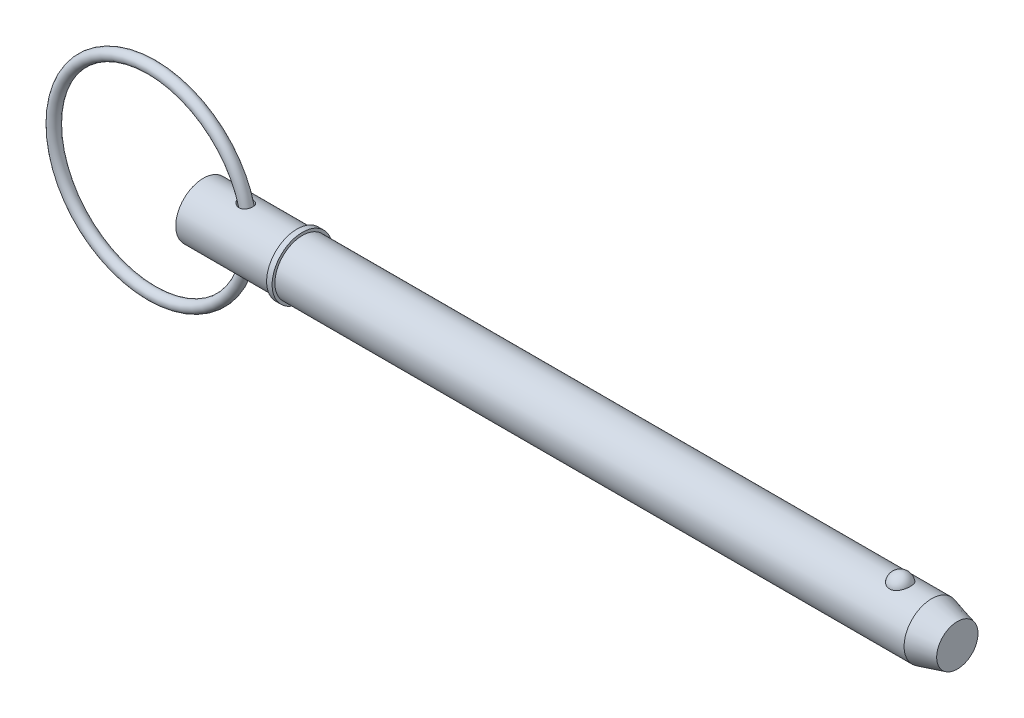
ISO-10303-21;
HEADER;
FILE_DESCRIPTION(('STEP AP214'),'2;1');
FILE_NAME('part.step','',(''),(''),'','','');
FILE_SCHEMA(('AUTOMOTIVE_DESIGN { 1 0 10303 214 1 1 1 1 }'));
ENDSEC;
DATA;
#1=APPLICATION_CONTEXT('core data for automotive mechanical design processes');
#2=APPLICATION_PROTOCOL_DEFINITION('international standard','automotive_design',2000,#1);
#3=PRODUCT_CONTEXT('',#1,'mechanical');
#4=PRODUCT('Part','Part','',(#3));
#5=PRODUCT_RELATED_PRODUCT_CATEGORY('part','',(#4));
#6=PRODUCT_DEFINITION_FORMATION('','',#4);
#7=PRODUCT_DEFINITION_CONTEXT('part definition',#1,'design');
#8=PRODUCT_DEFINITION('design','',#6,#7);
#9=PRODUCT_DEFINITION_SHAPE('','',#8);
#10=(LENGTH_UNIT() NAMED_UNIT(*) SI_UNIT(.MILLI.,.METRE.));
#11=(NAMED_UNIT(*) PLANE_ANGLE_UNIT() SI_UNIT($,.RADIAN.));
#12=(NAMED_UNIT(*) SI_UNIT($,.STERADIAN.) SOLID_ANGLE_UNIT());
#13=UNCERTAINTY_MEASURE_WITH_UNIT(LENGTH_MEASURE(1.E-05),#10,'distance_accuracy_value','');
#14=(GEOMETRIC_REPRESENTATION_CONTEXT(3) GLOBAL_UNCERTAINTY_ASSIGNED_CONTEXT((#13)) GLOBAL_UNIT_ASSIGNED_CONTEXT((#10,
#11,#12)) REPRESENTATION_CONTEXT('',''));
#15=CARTESIAN_POINT('',(0.,0.,0.));
#16=DIRECTION('',(0.,0.,1.));
#17=DIRECTION('',(1.,0.,0.));
#18=AXIS2_PLACEMENT_3D('',#15,#16,#17);
#19=CARTESIAN_POINT('',(-13.3805387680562,0.,0.));
#20=DIRECTION('',(0.,0.,1.));
#21=DIRECTION('',(1.,0.,0.));
#22=AXIS2_PLACEMENT_3D('',#19,#20,#21);
#23=TOROIDAL_SURFACE('',#22,25.4,1.429);
#24=CARTESIAN_POINT('',(13.4484612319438,0.,0.));
#25=VERTEX_POINT('',#24);
#26=VERTEX_LOOP('',#25);
#27=FACE_BOUND('',#26,.T.);
#28=ADVANCED_FACE('P0_F12',(#27),#23,.T.);
#29=CLOSED_SHELL('',(#28));
#30=MANIFOLD_SOLID_BREP('P0_B1',#29);
#31=CARTESIAN_POINT('',(0.,0.,0.));
#32=DIRECTION('',(1.,0.,0.));
#33=DIRECTION('',(0.,0.,-1.));
#34=AXIS2_PLACEMENT_3D('',#31,#32,#33);
#35=CYLINDRICAL_SURFACE('',#34,7.145);
#36=CARTESIAN_POINT('',(9.43029029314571,7.0820748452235,-0.946171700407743));
#37=CARTESIAN_POINT('',(9.49289741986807,7.07004660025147,-1.03619677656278));
#38=CARTESIAN_POINT('',(9.56370593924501,7.05703049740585,-1.12049617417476));
#39=CARTESIAN_POINT('',(9.71869321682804,7.03060933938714,-1.27585605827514));
#40=CARTESIAN_POINT('',(9.80290151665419,7.01720347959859,-1.34688652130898));
#41=CARTESIAN_POINT('',(9.98160385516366,6.99158714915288,-1.47408585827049));
#42=CARTESIAN_POINT('',(10.0760626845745,6.97937284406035,-1.53030346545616));
#43=CARTESIAN_POINT('',(10.2729508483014,6.95747410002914,-1.62697341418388));
#44=CARTESIAN_POINT('',(10.3753769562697,6.9477886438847,-1.66743209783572));
#45=CARTESIAN_POINT('',(10.5898946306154,6.93181594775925,-1.73266776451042));
#46=CARTESIAN_POINT('',(10.7022085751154,6.92567913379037,-1.75675727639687));
#47=CARTESIAN_POINT('',(10.9294935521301,6.91839634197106,-1.78523005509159));
#48=CARTESIAN_POINT('',(11.0444638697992,6.91724903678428,-1.78961856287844));
#49=CARTESIAN_POINT('',(11.2673249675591,6.92023954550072,-1.77801517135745));
#50=CARTESIAN_POINT('',(11.3752729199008,6.9241055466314,-1.7630715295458));
#51=CARTESIAN_POINT('',(11.5865707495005,6.93632220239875,-1.71437618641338));
#52=CARTESIAN_POINT('',(11.6899227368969,6.94467077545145,-1.68063321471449));
#53=CARTESIAN_POINT('',(11.8814537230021,6.96412118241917,-1.59802791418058));
#54=CARTESIAN_POINT('',(11.9701885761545,6.97498839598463,-1.55039425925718));
#55=CARTESIAN_POINT('',(12.1379548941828,6.99847346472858,-1.44066970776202));
#56=CARTESIAN_POINT('',(12.216987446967,7.01109112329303,-1.37858043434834));
#57=CARTESIAN_POINT('',(12.3614636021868,7.03632910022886,-1.24326778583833));
#58=CARTESIAN_POINT('',(12.4271729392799,7.04894297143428,-1.17032635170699));
#59=CARTESIAN_POINT('',(12.5455377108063,7.07306867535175,-1.01436746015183));
#60=CARTESIAN_POINT('',(12.5981928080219,7.08458047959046,-0.931349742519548));
#61=CARTESIAN_POINT('',(12.6896059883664,7.10535787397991,-0.75677050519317));
#62=CARTESIAN_POINT('',(12.7282356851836,7.11460247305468,-0.665139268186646));
#63=CARTESIAN_POINT('',(12.7900431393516,7.12971795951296,-0.476541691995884));
#64=CARTESIAN_POINT('',(12.8132203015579,7.13558871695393,-0.379575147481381));
#65=CARTESIAN_POINT('',(12.843715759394,7.14336270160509,-0.182249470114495));
#66=CARTESIAN_POINT('',(12.8509095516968,7.14523477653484,-0.0818698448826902));
#67=CARTESIAN_POINT('',(12.8489064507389,7.14471772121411,0.11871563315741));
#68=CARTESIAN_POINT('',(12.8397092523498,7.14232851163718,0.218921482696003));
#69=CARTESIAN_POINT('',(12.8051110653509,7.13353949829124,0.416446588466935));
#70=CARTESIAN_POINT('',(12.7796895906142,7.12713462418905,0.51376203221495));
#71=CARTESIAN_POINT('',(12.7132079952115,7.1110024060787,0.702607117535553));
#72=CARTESIAN_POINT('',(12.6721476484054,7.10127501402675,0.794136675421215));
#73=CARTESIAN_POINT('',(12.5754142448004,7.07957648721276,0.9686879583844));
#74=CARTESIAN_POINT('',(12.5197583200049,7.06760798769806,1.05171950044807));
#75=CARTESIAN_POINT('',(12.3951873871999,7.04275315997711,1.20699878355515));
#76=CARTESIAN_POINT('',(12.3262733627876,7.02986689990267,1.27924732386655));
#77=CARTESIAN_POINT('',(12.1775943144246,7.00473797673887,1.41035599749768));
#78=CARTESIAN_POINT('',(12.0979195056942,6.99249102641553,1.46931758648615));
#79=CARTESIAN_POINT('',(11.9295314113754,6.96991222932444,1.57295053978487));
#80=CARTESIAN_POINT('',(11.840819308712,6.9595801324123,1.61762377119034));
#81=CARTESIAN_POINT('',(11.6577653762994,6.94204625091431,1.69128599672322));
#82=CARTESIAN_POINT('',(11.5634812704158,6.93481718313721,1.72041226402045));
#83=CARTESIAN_POINT('',(11.3712731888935,6.92407027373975,1.76316901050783));
#84=CARTESIAN_POINT('',(11.2733489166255,6.92055273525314,1.7767982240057));
#85=CARTESIAN_POINT('',(11.0745092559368,6.91745053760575,1.78883853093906));
#86=CARTESIAN_POINT('',(10.9735737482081,6.91794816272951,1.7869312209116));
#87=CARTESIAN_POINT('',(10.7732766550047,6.92286647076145,1.76777696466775));
#88=CARTESIAN_POINT('',(10.6739155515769,6.92728833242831,1.75052540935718));
#89=CARTESIAN_POINT('',(10.4726907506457,6.93987626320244,1.69995986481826));
#90=CARTESIAN_POINT('',(10.3710860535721,6.94826759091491,1.66567223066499));
#91=CARTESIAN_POINT('',(10.1746512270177,6.96783543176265,1.5818155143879));
#92=CARTESIAN_POINT('',(10.0798244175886,6.97901329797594,1.53223900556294));
#93=CARTESIAN_POINT('',(9.89353725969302,7.00369413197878,1.41530336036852));
#94=CARTESIAN_POINT('',(9.80266896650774,7.01729943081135,1.34701798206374));
#95=CARTESIAN_POINT('',(9.63408859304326,7.0446567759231,1.19571433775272));
#96=CARTESIAN_POINT('',(9.55637809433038,7.05840883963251,1.11269430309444));
#97=CARTESIAN_POINT('',(9.41909992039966,7.083998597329,0.935821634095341));
#98=CARTESIAN_POINT('',(9.3591283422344,7.09587546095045,0.842290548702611));
#99=CARTESIAN_POINT('',(9.25811978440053,7.11649414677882,0.645207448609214));
#100=CARTESIAN_POINT('',(9.2170578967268,7.12524008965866,0.541668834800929));
#101=CARTESIAN_POINT('',(9.16044503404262,7.13745944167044,0.341322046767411));
#102=CARTESIAN_POINT('',(9.14237352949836,7.14144984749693,0.24525723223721));
#103=CARTESIAN_POINT('',(9.12416132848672,7.14547143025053,0.0513577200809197));
#104=CARTESIAN_POINT('',(9.12401221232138,7.14550446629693,-0.0464761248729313));
#105=CARTESIAN_POINT('',(9.14075660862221,7.14180686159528,-0.230866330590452));
#106=CARTESIAN_POINT('',(9.15598246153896,7.13844450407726,-0.317588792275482));
#107=CARTESIAN_POINT('',(9.20015637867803,7.1288735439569,-0.487231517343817));
#108=CARTESIAN_POINT('',(9.22909411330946,7.12266708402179,-0.570154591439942));
#109=CARTESIAN_POINT('',(9.2869632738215,7.11060500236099,-0.702183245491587));
#110=CARTESIAN_POINT('',(9.31233771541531,7.10538970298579,-0.752949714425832));
#111=CARTESIAN_POINT('',(9.36784352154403,7.09422889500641,-0.85170964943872));
#112=CARTESIAN_POINT('',(9.39797435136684,7.08828346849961,-0.899703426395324));
#113=CARTESIAN_POINT('',(9.43029029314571,7.0820748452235,-0.946171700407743));
#114=B_SPLINE_CURVE_WITH_KNOTS('',3,(#36,#37,#38,#39,#40,#41,#42,#43,#44,#45,#46,#47,#48,#49,
#50,#51,#52,#53,#54,#55,#56,#57,#58,#59,#60,#61,#62,#63,#64,#65,#66,#67,#68,#69,#70,#71,#72,#73,
#74,#75,#76,#77,#78,#79,#80,#81,#82,#83,#84,#85,#86,#87,#88,#89,#90,#91,#92,#93,#94,#95,#96,#97,
#98,#99,#100,#101,#102,#103,#104,#105,#106,#107,#108,#109,#110,#111,#112,#113),.UNSPECIFIED.,
.T.,.F.,(4,2,2,2,2,2,2,2,2,2,2,2,2,2,2,2,2,2,2,2,2,2,2,2,2,2,2,2,2,2,2,2,2,2,2,2,2,2,4),(0.,
0.330712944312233,0.662165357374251,0.992513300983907,1.32272815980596,1.66607248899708,
2.00932547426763,2.33472339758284,2.65997034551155,2.96236844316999,3.26473260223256,
3.56029376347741,3.85586255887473,4.15407251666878,4.45229395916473,4.75283038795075,
5.05337241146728,5.35429467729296,5.6552212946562,5.95579625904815,6.25634893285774,
6.55452242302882,6.85265693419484,7.14811357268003,7.44359434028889,7.74514565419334,
8.04678757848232,8.368090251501,8.68954924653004,9.03133562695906,9.37316306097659,
9.70647113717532,10.0393389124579,10.3311793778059,10.6228827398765,10.8860177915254,
11.1489549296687,11.3196783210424,11.4903825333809),.UNSPECIFIED.);
#115=CARTESIAN_POINT('',(9.43029029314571,7.0820748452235,-0.946171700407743));
#116=VERTEX_POINT('',#115);
#117=EDGE_CURVE('P1_E42',#116,#116,#114,.T.);
#118=ORIENTED_EDGE('',*,*,#117,.T.);
#119=EDGE_LOOP('',(#118));
#120=FACE_BOUND('',#119,.T.);
#121=CARTESIAN_POINT('',(0.,0.,0.));
#122=DIRECTION('',(1.,0.,0.));
#123=DIRECTION('',(0.,0.,-1.));
#124=AXIS2_PLACEMENT_3D('',#121,#122,#123);
#125=CIRCLE('',#124,7.145);
#126=CARTESIAN_POINT('',(0.,0.,-7.145));
#127=VERTEX_POINT('',#126);
#128=EDGE_CURVE('P1_E9',#127,#127,#125,.T.);
#129=ORIENTED_EDGE('',*,*,#128,.T.);
#130=EDGE_LOOP('',(#129));
#131=FACE_BOUND('',#130,.T.);
#132=CARTESIAN_POINT('',(24.271,0.,0.));
#133=DIRECTION('',(1.,0.,0.));
#134=DIRECTION('',(0.,0.,-1.));
#135=AXIS2_PLACEMENT_3D('',#132,#133,#134);
#136=CIRCLE('',#135,7.145);
#137=CARTESIAN_POINT('',(24.271,0.,-7.145));
#138=VERTEX_POINT('',#137);
#139=EDGE_CURVE('P1_E25',#138,#138,#136,.T.);
#140=ORIENTED_EDGE('',*,*,#139,.F.);
#141=EDGE_LOOP('',(#140));
#142=FACE_BOUND('',#141,.T.);
#143=CARTESIAN_POINT('',(9.43029029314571,-7.0820748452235,-0.946171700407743));
#144=CARTESIAN_POINT('',(9.37760063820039,-7.09219753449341,-0.870403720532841));
#145=CARTESIAN_POINT('',(9.33068640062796,-7.10162619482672,-0.790535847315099));
#146=CARTESIAN_POINT('',(9.25028000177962,-7.11818229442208,-0.624083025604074));
#147=CARTESIAN_POINT('',(9.21677847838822,-7.12531133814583,-0.537502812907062));
#148=CARTESIAN_POINT('',(9.16475883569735,-7.13651886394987,-0.359324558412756));
#149=CARTESIAN_POINT('',(9.14630423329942,-7.14058440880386,-0.267706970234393));
#150=CARTESIAN_POINT('',(9.12573334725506,-7.14512216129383,-0.0825612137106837));
#151=CARTESIAN_POINT('',(9.12361335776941,-7.1455951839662,0.0109665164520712));
#152=CARTESIAN_POINT('',(9.13548667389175,-7.14296952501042,0.191627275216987));
#153=CARTESIAN_POINT('',(9.14858103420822,-7.14007009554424,0.278824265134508));
#154=CARTESIAN_POINT('',(9.18869656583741,-7.1313430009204,0.449782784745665));
#155=CARTESIAN_POINT('',(9.21571947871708,-7.1255149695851,0.533543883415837));
#156=CARTESIAN_POINT('',(9.282939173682,-7.11140544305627,0.696984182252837));
#157=CARTESIAN_POINT('',(9.32334793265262,-7.10308469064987,0.7765721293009));
#158=CARTESIAN_POINT('',(9.41555290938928,-7.08481187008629,0.928623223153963));
#159=CARTESIAN_POINT('',(9.4673531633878,-7.07485922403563,1.00108383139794));
#160=CARTESIAN_POINT('',(9.58690514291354,-7.05302654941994,1.14530893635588));
#161=CARTESIAN_POINT('',(9.65578345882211,-7.04105486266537,1.21612477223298));
#162=CARTESIAN_POINT('',(9.80342908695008,-7.01727063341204,1.34660507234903));
#163=CARTESIAN_POINT('',(9.88220203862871,-7.00545818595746,1.40626312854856));
#164=CARTESIAN_POINT('',(10.0573217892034,-6.98177399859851,1.51973713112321));
#165=CARTESIAN_POINT('',(10.1546474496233,-6.9700532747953,1.57208037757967));
#166=CARTESIAN_POINT('',(10.3567277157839,-6.94950828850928,1.66055104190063));
#167=CARTESIAN_POINT('',(10.4614845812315,-6.94068491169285,1.69667350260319));
#168=CARTESIAN_POINT('',(10.6792116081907,-6.92685379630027,1.75230777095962));
#169=CARTESIAN_POINT('',(10.7923373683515,-6.92197732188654,1.77125049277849));
#170=CARTESIAN_POINT('',(11.0202699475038,-6.91736328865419,1.78919210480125));
#171=CARTESIAN_POINT('',(11.1350759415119,-6.91762328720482,1.78820047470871));
#172=CARTESIAN_POINT('',(11.355627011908,-6.92328130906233,1.76615765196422));
#173=CARTESIAN_POINT('',(11.4615007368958,-6.92836826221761,1.74632083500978));
#174=CARTESIAN_POINT('',(11.6678083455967,-6.94272508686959,1.68833625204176));
#175=CARTESIAN_POINT('',(11.7682443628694,-6.9519933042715,1.65019572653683));
#176=CARTESIAN_POINT('',(11.9539217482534,-6.97285816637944,1.55957439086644));
#177=CARTESIAN_POINT('',(12.0397280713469,-6.98426147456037,1.50820229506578));
#178=CARTESIAN_POINT('',(12.2011249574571,-7.00842344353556,1.39160266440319));
#179=CARTESIAN_POINT('',(12.276716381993,-7.0211819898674,1.32637629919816));
#180=CARTESIAN_POINT('',(12.4144868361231,-7.04639315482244,1.18508369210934));
#181=CARTESIAN_POINT('',(12.4768620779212,-7.05884739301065,1.10920872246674));
#182=CARTESIAN_POINT('',(12.5881779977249,-7.08230185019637,0.947973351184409));
#183=CARTESIAN_POINT('',(12.6371182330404,-7.09330202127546,0.862612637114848));
#184=CARTESIAN_POINT('',(12.7208404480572,-7.11277016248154,0.68387168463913));
#185=CARTESIAN_POINT('',(12.7554736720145,-7.12121129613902,0.590418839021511));
#186=CARTESIAN_POINT('',(12.8090653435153,-7.13450309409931,0.398877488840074));
#187=CARTESIAN_POINT('',(12.8280232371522,-7.13935363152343,0.300788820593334));
#188=CARTESIAN_POINT('',(12.8499077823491,-7.14496695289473,0.102058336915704));
#189=CARTESIAN_POINT('',(12.8527265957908,-7.14570223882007,0.00140385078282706));
#190=CARTESIAN_POINT('',(12.8419792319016,-7.14293198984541,-0.198968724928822));
#191=CARTESIAN_POINT('',(12.8284127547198,-7.13942637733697,-0.298686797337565));
#192=CARTESIAN_POINT('',(12.7851853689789,-7.12854635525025,-0.494442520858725));
#193=CARTESIAN_POINT('',(12.7555107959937,-7.12116866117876,-0.590476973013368));
#194=CARTESIAN_POINT('',(12.6807437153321,-7.10334272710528,-0.776042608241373));
#195=CARTESIAN_POINT('',(12.6356510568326,-7.09289445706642,-0.865573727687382));
#196=CARTESIAN_POINT('',(12.5312128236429,-7.07009703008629,-1.03541867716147));
#197=CARTESIAN_POINT('',(12.4718917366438,-7.0577511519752,-1.11574799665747));
#198=CARTESIAN_POINT('',(12.3404461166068,-7.03252701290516,-1.26504204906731));
#199=CARTESIAN_POINT('',(12.2683227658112,-7.01964880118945,-1.3340078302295));
#200=CARTESIAN_POINT('',(12.1139052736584,-6.99493588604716,-1.45803732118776));
#201=CARTESIAN_POINT('',(12.031708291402,-6.98309284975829,-1.51322032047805));
#202=CARTESIAN_POINT('',(11.858962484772,-6.96164945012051,-1.60900039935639));
#203=CARTESIAN_POINT('',(11.7684146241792,-6.95204882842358,-1.6495991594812));
#204=CARTESIAN_POINT('',(11.5822744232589,-6.93618392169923,-1.71508374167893));
#205=CARTESIAN_POINT('',(11.4867225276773,-6.92989640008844,-1.74007923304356));
#206=CARTESIAN_POINT('',(11.292703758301,-6.92114809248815,-1.77455680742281));
#207=CARTESIAN_POINT('',(11.1942365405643,-6.91868775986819,-1.7840370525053));
#208=CARTESIAN_POINT('',(10.9943797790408,-6.91771041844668,-1.78782317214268));
#209=CARTESIAN_POINT('',(10.8929824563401,-6.9193005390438,-1.78171679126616));
#210=CARTESIAN_POINT('',(10.6924353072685,-6.92632816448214,-1.75419409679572));
#211=CARTESIAN_POINT('',(10.5932861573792,-6.93176681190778,-1.73277323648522));
#212=CARTESIAN_POINT('',(10.3927770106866,-6.94630717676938,-1.67356884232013));
#213=CARTESIAN_POINT('',(10.2917367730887,-6.95563581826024,-1.63475796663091));
#214=CARTESIAN_POINT('',(10.0971768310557,-6.97681957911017,-1.54184188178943));
#215=CARTESIAN_POINT('',(10.0036623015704,-6.9886764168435,-1.48772626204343));
#216=CARTESIAN_POINT('',(9.82098935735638,-7.01440230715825,-1.36146688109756));
#217=CARTESIAN_POINT('',(9.73247440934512,-7.0283510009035,-1.28840361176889));
#218=CARTESIAN_POINT('',(9.56978695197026,-7.05591334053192,-1.12770855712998));
#219=CARTESIAN_POINT('',(9.49560170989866,-7.06952727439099,-1.0400898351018));
#220=CARTESIAN_POINT('',(9.43029029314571,-7.0820748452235,-0.946171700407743));
#221=B_SPLINE_CURVE_WITH_KNOTS('',3,(#143,#144,#145,#146,#147,#148,#149,#150,#151,#152,#153,
#154,#155,#156,#157,#158,#159,#160,#161,#162,#163,#164,#165,#166,#167,#168,#169,#170,#171,#172,
#173,#174,#175,#176,#177,#178,#179,#180,#181,#182,#183,#184,#185,#186,#187,#188,#189,#190,#191,
#192,#193,#194,#195,#196,#197,#198,#199,#200,#201,#202,#203,#204,#205,#206,#207,#208,#209,#210,
#211,#212,#213,#214,#215,#216,#217,#218,#219,#220),.UNSPECIFIED.,.T.,.F.,(4,2,2,2,2,2,2,2,2,2,2,
2,2,2,2,2,2,2,2,2,2,2,2,2,2,2,2,2,2,2,2,2,2,2,2,2,2,2,4),(0.,0.278197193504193,
0.556199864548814,0.835370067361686,1.11447693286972,1.37789669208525,1.64134939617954,
1.9091912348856,2.17712812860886,2.4744625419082,2.77196719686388,3.10386520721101,
3.43586457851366,3.77849767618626,4.1209678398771,4.44276705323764,4.76443907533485,
5.06494526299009,5.36542609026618,5.6610728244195,5.95672929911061,6.25538683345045,
6.5540549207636,6.85471634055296,7.15538326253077,7.45630563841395,7.75723095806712,
8.05764204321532,8.35802540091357,8.65571107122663,8.95336242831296,9.24889743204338,
9.54446744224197,9.84793560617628,10.1514939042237,10.4760045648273,10.8007364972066,
11.1458836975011,11.4907227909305),.UNSPECIFIED.);
#222=CARTESIAN_POINT('',(9.43029029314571,-7.0820748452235,-0.946171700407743));
#223=VERTEX_POINT('',#222);
#224=EDGE_CURVE('P1_E17',#223,#223,#221,.T.);
#225=ORIENTED_EDGE('',*,*,#224,.T.);
#226=EDGE_LOOP('',(#225));
#227=FACE_BOUND('',#226,.T.);
#228=ADVANCED_FACE('P1_F13',(#120,#131,#142,#227),#35,.T.);
#229=CARTESIAN_POINT('',(0.,0.,0.));
#230=DIRECTION('',(1.,0.,0.));
#231=DIRECTION('',(0.,0.,-1.));
#232=AXIS2_PLACEMENT_3D('',#229,#230,#231);
#233=CYLINDRICAL_SURFACE('',#232,7.145);
#234=CARTESIAN_POINT('',(188.88362424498,0.,0.));
#235=DIRECTION('',(1.,0.,0.));
#236=DIRECTION('',(0.,0.,-1.));
#237=AXIS2_PLACEMENT_3D('',#234,#235,#236);
#238=CIRCLE('',#237,7.145);
#239=CARTESIAN_POINT('',(188.88362424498,0.,-7.145));
#240=VERTEX_POINT('',#239);
#241=EDGE_CURVE('P1_E99',#240,#240,#238,.T.);
#242=ORIENTED_EDGE('',*,*,#241,.F.);
#243=EDGE_LOOP('',(#242));
#244=FACE_BOUND('',#243,.T.);
#245=CARTESIAN_POINT('',(25.7,0.,0.));
#246=DIRECTION('',(1.,0.,0.));
#247=DIRECTION('',(0.,0.,-1.));
#248=AXIS2_PLACEMENT_3D('',#245,#246,#247);
#249=CIRCLE('',#248,7.145);
#250=CARTESIAN_POINT('',(25.7,0.,-7.145));
#251=VERTEX_POINT('',#250);
#252=EDGE_CURVE('P1_E96',#251,#251,#249,.T.);
#253=ORIENTED_EDGE('',*,*,#252,.T.);
#254=EDGE_LOOP('',(#253));
#255=FACE_BOUND('',#254,.T.);
#256=CARTESIAN_POINT('',(180.739503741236,6.6032862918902,2.72903557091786));
#257=CARTESIAN_POINT('',(180.598315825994,6.60329644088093,2.72902496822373));
#258=CARTESIAN_POINT('',(180.456883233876,6.60799490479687,2.71772840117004));
#259=CARTESIAN_POINT('',(180.177955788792,6.62628236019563,2.67281935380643));
#260=CARTESIAN_POINT('',(180.040472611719,6.63989534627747,2.63914664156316));
#261=CARTESIAN_POINT('',(179.773889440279,6.67440775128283,2.5505964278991));
#262=CARTESIAN_POINT('',(179.644768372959,6.69528793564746,2.49577486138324));
#263=CARTESIAN_POINT('',(179.397869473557,6.74205585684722,2.36651799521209));
#264=CARTESIAN_POINT('',(179.280086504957,6.76794130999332,2.29209163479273));
#265=CARTESIAN_POINT('',(179.05516710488,6.82286177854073,2.1231293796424));
#266=CARTESIAN_POINT('',(178.948440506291,6.85196655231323,2.02807107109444));
#267=CARTESIAN_POINT('',(178.751918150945,6.90970232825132,1.82167822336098));
#268=CARTESIAN_POINT('',(178.662127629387,6.93833318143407,1.71033867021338));
#269=CARTESIAN_POINT('',(178.497667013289,6.99351679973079,1.46891951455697));
#270=CARTESIAN_POINT('',(178.423844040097,7.01992110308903,1.33822781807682));
#271=CARTESIAN_POINT('',(178.298088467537,7.06643385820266,1.06566567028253));
#272=CARTESIAN_POINT('',(178.24615735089,7.08654188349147,0.923794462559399));
#273=CARTESIAN_POINT('',(178.164732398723,7.11862399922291,0.630993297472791));
#274=CARTESIAN_POINT('',(178.135516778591,7.13049704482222,0.479974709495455));
#275=CARTESIAN_POINT('',(178.101174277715,7.14449484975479,0.174782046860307));
#276=CARTESIAN_POINT('',(178.096046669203,7.14661990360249,0.0206080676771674));
#277=CARTESIAN_POINT('',(178.109938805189,7.14092465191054,-0.285506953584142));
#278=CARTESIAN_POINT('',(178.128810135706,7.1331654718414,-0.437455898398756));
#279=CARTESIAN_POINT('',(178.190062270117,7.10859076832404,-0.73577860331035));
#280=CARTESIAN_POINT('',(178.232443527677,7.0917750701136,-0.882152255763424));
#281=CARTESIAN_POINT('',(178.339934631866,7.05076716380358,-1.165431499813));
#282=CARTESIAN_POINT('',(178.405075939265,7.02656475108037,-1.30232366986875));
#283=CARTESIAN_POINT('',(178.556759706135,6.97329145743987,-1.56265907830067));
#284=CARTESIAN_POINT('',(178.643303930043,6.94422017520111,-1.68610120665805));
#285=CARTESIAN_POINT('',(178.836465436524,6.88415108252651,-1.91671004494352));
#286=CARTESIAN_POINT('',(178.943180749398,6.85314438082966,-2.02379244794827));
#287=CARTESIAN_POINT('',(179.173974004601,6.79282069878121,-2.21787433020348));
#288=CARTESIAN_POINT('',(179.298050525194,6.76350358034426,-2.30487545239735));
#289=CARTESIAN_POINT('',(179.557678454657,6.71060580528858,-2.45458647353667));
#290=CARTESIAN_POINT('',(179.692938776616,6.68691885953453,-2.51776240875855));
#291=CARTESIAN_POINT('',(179.973277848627,6.64741247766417,-2.62030218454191));
#292=CARTESIAN_POINT('',(180.118352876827,6.63159007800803,-2.65967499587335));
#293=CARTESIAN_POINT('',(180.406347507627,6.61038594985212,-2.71193301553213));
#294=CARTESIAN_POINT('',(180.54900807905,6.60451880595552,-2.72605165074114));
#295=CARTESIAN_POINT('',(180.83480047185,6.60240611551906,-2.73116688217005));
#296=CARTESIAN_POINT('',(180.977932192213,6.60615862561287,-2.72216814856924));
#297=CARTESIAN_POINT('',(181.255848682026,6.62256094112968,-2.68200435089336));
#298=CARTESIAN_POINT('',(181.390754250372,6.63492533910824,-2.65154998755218));
#299=CARTESIAN_POINT('',(181.65332009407,6.66687445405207,-2.57015684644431));
#300=CARTESIAN_POINT('',(181.78097978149,6.68645975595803,-2.51921640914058));
#301=CARTESIAN_POINT('',(182.028577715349,6.731272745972,-2.39693610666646));
#302=CARTESIAN_POINT('',(182.148287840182,6.75661381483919,-2.32517694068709));
#303=CARTESIAN_POINT('',(182.374159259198,6.81006003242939,-2.16363812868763));
#304=CARTESIAN_POINT('',(182.480317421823,6.83816581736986,-2.07385432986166));
#305=CARTESIAN_POINT('',(182.681862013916,6.89580469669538,-1.87357235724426));
#306=CARTESIAN_POINT('',(182.776440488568,6.92533863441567,-1.76226074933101));
#307=CARTESIAN_POINT('',(182.946332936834,6.98139526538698,-1.52511696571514));
#308=CARTESIAN_POINT('',(183.021643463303,7.0079174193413,-1.39928219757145));
#309=CARTESIAN_POINT('',(183.153595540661,7.05607625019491,-1.13215977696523));
#310=CARTESIAN_POINT('',(183.209568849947,7.07753119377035,-0.990508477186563));
#311=CARTESIAN_POINT('',(183.298296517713,7.11222355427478,-0.699154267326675));
#312=CARTESIAN_POINT('',(183.331050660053,7.12546089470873,-0.549451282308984));
#313=CARTESIAN_POINT('',(183.372689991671,7.1423758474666,-0.246120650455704));
#314=CARTESIAN_POINT('',(183.381558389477,7.14604673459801,-0.0924903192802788));
#315=CARTESIAN_POINT('',(183.375194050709,7.14343510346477,0.214181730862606));
#316=CARTESIAN_POINT('',(183.359961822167,7.13715279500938,0.367223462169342));
#317=CARTESIAN_POINT('',(183.305845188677,7.1153294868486,0.66759501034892));
#318=CARTESIAN_POINT('',(183.267077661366,7.09983424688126,0.814949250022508));
#319=CARTESIAN_POINT('',(183.166770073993,7.06119140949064,1.10063221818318));
#320=CARTESIAN_POINT('',(183.105228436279,7.03804328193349,1.238960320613));
#321=CARTESIAN_POINT('',(182.960207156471,6.98632429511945,1.50352300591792));
#322=CARTESIAN_POINT('',(182.876606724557,6.95772382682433,1.62968561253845));
#323=CARTESIAN_POINT('',(182.68938046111,6.89823072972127,1.86554304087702));
#324=CARTESIAN_POINT('',(182.585755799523,6.86733823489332,1.97523882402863));
#325=CARTESIAN_POINT('',(182.361076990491,6.80676456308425,2.174822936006));
#326=CARTESIAN_POINT('',(182.240067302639,6.7770805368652,2.26476035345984));
#327=CARTESIAN_POINT('',(181.983340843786,6.72230501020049,2.42252989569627));
#328=CARTESIAN_POINT('',(181.84761851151,6.69721525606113,2.49035362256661));
#329=CARTESIAN_POINT('',(181.570402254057,6.65552591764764,2.59967646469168));
#330=CARTESIAN_POINT('',(181.429281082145,6.63865794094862,2.64202017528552));
#331=CARTESIAN_POINT('',(181.141444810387,6.6142503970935,2.70255841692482));
#332=CARTESIAN_POINT('',(180.994748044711,6.60668259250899,2.72082606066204));
#333=CARTESIAN_POINT('',(180.811679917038,6.60358754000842,2.7283033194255));
#334=CARTESIAN_POINT('',(180.775599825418,6.60328369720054,2.72903828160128));
#335=CARTESIAN_POINT('',(180.739503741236,6.6032862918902,2.72903557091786));
#336=B_SPLINE_CURVE_WITH_KNOTS('',3,(#256,#257,#258,#259,#260,#261,#262,#263,#264,#265,#266,
#267,#268,#269,#270,#271,#272,#273,#274,#275,#276,#277,#278,#279,#280,#281,#282,#283,#284,#285,
#286,#287,#288,#289,#290,#291,#292,#293,#294,#295,#296,#297,#298,#299,#300,#301,#302,#303,#304,
#305,#306,#307,#308,#309,#310,#311,#312,#313,#314,#315,#316,#317,#318,#319,#320,#321,#322,#323,
#324,#325,#326,#327,#328,#329,#330,#331,#332,#333,#334,#335),.UNSPECIFIED.,.T.,.F.,(4,2,2,2,2,2,
2,2,2,2,2,2,2,2,2,2,2,2,2,2,2,2,2,2,2,2,2,2,2,2,2,2,2,2,2,2,2,2,2,4),(0.,0.423468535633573,
0.848081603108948,1.2715792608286,1.69488414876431,2.13051395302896,2.56627819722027,
3.02136706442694,3.4764867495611,3.93709649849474,4.39769233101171,4.8554535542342,
5.31322361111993,5.77162895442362,6.23007210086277,6.69080337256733,7.1514969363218,
7.60264329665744,8.05361952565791,8.48189729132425,8.91008854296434,9.32472524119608,
9.73939553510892,10.1630783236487,10.5868588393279,11.031907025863,11.4770347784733,
11.9362874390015,12.3955443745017,12.8551240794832,13.3146940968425,13.7720003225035,
14.2293382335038,14.6892343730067,15.1491036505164,15.6078171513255,16.0667046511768,
16.5093965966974,16.9507410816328,17.0590049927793),.UNSPECIFIED.);
#337=CARTESIAN_POINT('',(180.739503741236,6.6032862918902,2.72903557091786));
#338=VERTEX_POINT('',#337);
#339=EDGE_CURVE('P1_E34',#338,#338,#336,.T.);
#340=ORIENTED_EDGE('',*,*,#339,.T.);
#341=EDGE_LOOP('',(#340));
#342=FACE_BOUND('',#341,.T.);
#343=ADVANCED_FACE('P1_F46',(#244,#255,#342),#233,.T.);
#344=CARTESIAN_POINT('',(0.,0.,0.));
#345=DIRECTION('',(-1.,0.,0.));
#346=DIRECTION('',(0.,0.,1.));
#347=AXIS2_PLACEMENT_3D('',#344,#345,#346);
#348=PLANE('',#347);
#349=ORIENTED_EDGE('',*,*,#128,.F.);
#350=EDGE_LOOP('',(#349));
#351=FACE_BOUND('',#350,.T.);
#352=ADVANCED_FACE('P1_F15',(#351),#348,.T.);
#353=CARTESIAN_POINT('',(24.271,7.145,0.));
#354=DIRECTION('',(-1.,0.,0.));
#355=DIRECTION('',(0.,0.,1.));
#356=AXIS2_PLACEMENT_3D('',#353,#354,#355);
#357=PLANE('',#356);
#358=ORIENTED_EDGE('',*,*,#139,.T.);
#359=EDGE_LOOP('',(#358));
#360=FACE_BOUND('',#359,.T.);
#361=CARTESIAN_POINT('',(24.271,0.,0.));
#362=DIRECTION('',(1.,0.,0.));
#363=DIRECTION('',(0.,0.,-1.));
#364=AXIS2_PLACEMENT_3D('',#361,#362,#363);
#365=CIRCLE('',#364,7.8595);
#366=CARTESIAN_POINT('',(24.271,0.,-7.8595));
#367=VERTEX_POINT('',#366);
#368=EDGE_CURVE('P1_E30',#367,#367,#365,.T.);
#369=ORIENTED_EDGE('',*,*,#368,.F.);
#370=EDGE_LOOP('',(#369));
#371=FACE_BOUND('',#370,.T.);
#372=ADVANCED_FACE('P1_F81',(#360,#371),#357,.T.);
#373=CARTESIAN_POINT('',(0.,0.,0.));
#374=DIRECTION('',(1.,0.,0.));
#375=DIRECTION('',(0.,0.,-1.));
#376=AXIS2_PLACEMENT_3D('',#373,#374,#375);
#377=CYLINDRICAL_SURFACE('',#376,7.8595);
#378=ORIENTED_EDGE('',*,*,#368,.T.);
#379=EDGE_LOOP('',(#378));
#380=FACE_BOUND('',#379,.T.);
#381=CARTESIAN_POINT('',(25.7,0.,0.));
#382=DIRECTION('',(1.,0.,0.));
#383=DIRECTION('',(0.,0.,-1.));
#384=AXIS2_PLACEMENT_3D('',#381,#382,#383);
#385=CIRCLE('',#384,7.8595);
#386=CARTESIAN_POINT('',(25.7,0.,-7.8595));
#387=VERTEX_POINT('',#386);
#388=EDGE_CURVE('P1_E95',#387,#387,#385,.T.);
#389=ORIENTED_EDGE('',*,*,#388,.F.);
#390=EDGE_LOOP('',(#389));
#391=FACE_BOUND('',#390,.T.);
#392=ADVANCED_FACE('P1_F68',(#380,#391),#377,.T.);
#393=CARTESIAN_POINT('',(25.7,7.8595,0.));
#394=DIRECTION('',(1.,0.,0.));
#395=DIRECTION('',(0.,0.,-1.));
#396=AXIS2_PLACEMENT_3D('',#393,#394,#395);
#397=PLANE('',#396);
#398=ORIENTED_EDGE('',*,*,#388,.T.);
#399=EDGE_LOOP('',(#398));
#400=FACE_BOUND('',#399,.T.);
#401=ORIENTED_EDGE('',*,*,#252,.F.);
#402=EDGE_LOOP('',(#401));
#403=FACE_BOUND('',#402,.T.);
#404=ADVANCED_FACE('P1_F62',(#400,#403),#397,.T.);
#405=CARTESIAN_POINT('',(195.55,0.,0.));
#406=DIRECTION('',(-1.,0.,0.));
#407=DIRECTION('',(0.,0.,1.));
#408=AXIS2_PLACEMENT_3D('',#405,#406,#407);
#409=CONICAL_SURFACE('',#408,5.35875000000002,0.26179938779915);
#410=ORIENTED_EDGE('',*,*,#241,.T.);
#411=EDGE_LOOP('',(#410));
#412=FACE_BOUND('',#411,.T.);
#413=CARTESIAN_POINT('',(195.55,0.,0.));
#414=DIRECTION('',(1.,0.,0.));
#415=DIRECTION('',(0.,0.,-1.));
#416=AXIS2_PLACEMENT_3D('',#413,#414,#415);
#417=CIRCLE('',#416,5.35875000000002);
#418=CARTESIAN_POINT('',(195.55,0.,-5.35875000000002));
#419=VERTEX_POINT('',#418);
#420=EDGE_CURVE('P1_E41',#419,#419,#417,.T.);
#421=ORIENTED_EDGE('',*,*,#420,.F.);
#422=EDGE_LOOP('',(#421));
#423=FACE_BOUND('',#422,.T.);
#424=ADVANCED_FACE('P1_F59',(#412,#423),#409,.T.);
#425=CARTESIAN_POINT('',(195.55,5.35875000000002,0.));
#426=DIRECTION('',(1.,0.,0.));
#427=DIRECTION('',(0.,0.,-1.));
#428=AXIS2_PLACEMENT_3D('',#425,#426,#427);
#429=PLANE('',#428);
#430=ORIENTED_EDGE('',*,*,#420,.T.);
#431=EDGE_LOOP('',(#430));
#432=FACE_BOUND('',#431,.T.);
#433=ADVANCED_FACE('P1_F55',(#432),#429,.T.);
#434=CARTESIAN_POINT('',(180.739503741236,6.4305,0.));
#435=DIRECTION('',(-1.,0.,0.));
#436=DIRECTION('',(0.,1.,0.));
#437=AXIS2_PLACEMENT_3D('',#434,#435,#436);
#438=SPHERICAL_SURFACE('',#437,2.73450000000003);
#439=ORIENTED_EDGE('',*,*,#339,.F.);
#440=EDGE_LOOP('',(#439));
#441=FACE_BOUND('',#440,.T.);
#442=ADVANCED_FACE('P1_F50',(#441),#438,.T.);
#443=CARTESIAN_POINT('',(-13.3805387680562,0.,0.));
#444=DIRECTION('',(0.,0.,1.));
#445=DIRECTION('',(1.,0.,0.));
#446=AXIS2_PLACEMENT_3D('',#443,#444,#445);
#447=TOROIDAL_SURFACE('',#446,25.4,1.78625);
#448=ORIENTED_EDGE('',*,*,#224,.F.);
#449=EDGE_LOOP('',(#448));
#450=FACE_BOUND('',#449,.T.);
#451=ORIENTED_EDGE('',*,*,#117,.F.);
#452=EDGE_LOOP('',(#451));
#453=FACE_BOUND('',#452,.T.);
#454=ADVANCED_FACE('P1_F54',(#450,#453),#447,.F.);
#455=CLOSED_SHELL('',(#228,#343,#352,#372,#392,#404,#424,#433,#442,#454));
#456=MANIFOLD_SOLID_BREP('P1_B1',#455);
#457=ADVANCED_BREP_SHAPE_REPRESENTATION('',(#18,#30,#456),#14);
#458=SHAPE_DEFINITION_REPRESENTATION(#9,#457);
ENDSEC;
END-ISO-10303-21;
